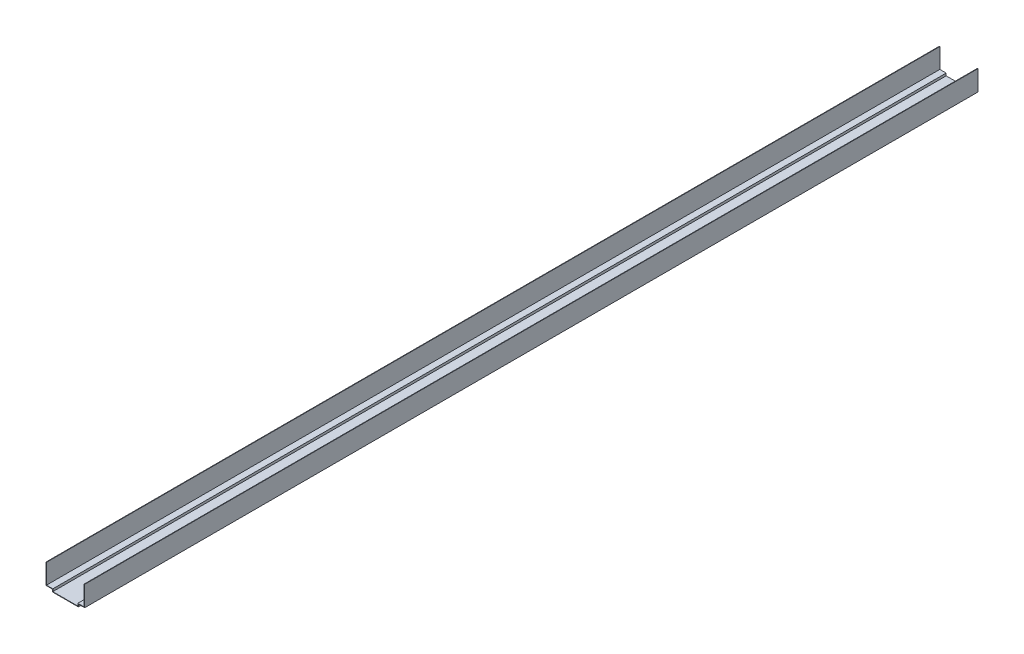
from build123d import *

# Parameters (mm, degrees)
LINEAR_AUSTRAGEN1_DEPTH = 5500


with BuildPart() as part:
    # Skizze1 → Linear austragen1 (new body)
    with BuildSketch(Plane.XY):
        Polygon((-119, 140.01), (-119, 15), (-80, 15), (-80, 0), (80, 0), (80, 15), (119, 15), (119, 140.01), (116, 140.01), (116, 18), (77, 18), (77, 3), (-77, 3), (-77, 18), (-116, 18), (-116, 140.01), align=None)
    extrude(amount=-LINEAR_AUSTRAGEN1_DEPTH)


solid = part.part
